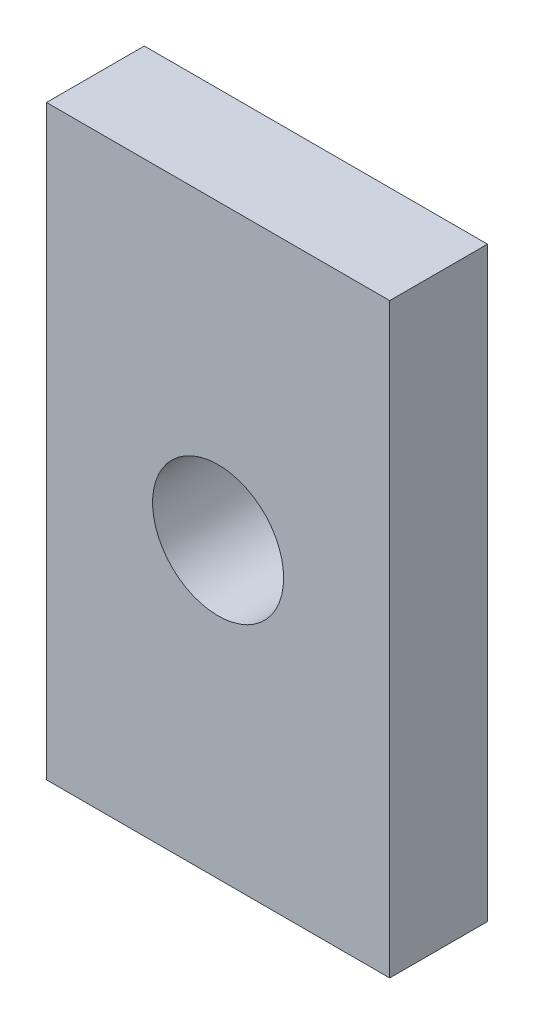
ISO-10303-21;
HEADER;
FILE_DESCRIPTION(('STEP AP214'),'2;1');
FILE_NAME('part.step','',(''),(''),'','','');
FILE_SCHEMA(('AUTOMOTIVE_DESIGN { 1 0 10303 214 1 1 1 1 }'));
ENDSEC;
DATA;
#1=APPLICATION_CONTEXT('core data for automotive mechanical design processes');
#2=APPLICATION_PROTOCOL_DEFINITION('international standard','automotive_design',2000,#1);
#3=PRODUCT_CONTEXT('',#1,'mechanical');
#4=PRODUCT('Part','Part','',(#3));
#5=PRODUCT_RELATED_PRODUCT_CATEGORY('part','',(#4));
#6=PRODUCT_DEFINITION_FORMATION('','',#4);
#7=PRODUCT_DEFINITION_CONTEXT('part definition',#1,'design');
#8=PRODUCT_DEFINITION('design','',#6,#7);
#9=PRODUCT_DEFINITION_SHAPE('','',#8);
#10=(LENGTH_UNIT() NAMED_UNIT(*) SI_UNIT(.MILLI.,.METRE.));
#11=(NAMED_UNIT(*) PLANE_ANGLE_UNIT() SI_UNIT($,.RADIAN.));
#12=(NAMED_UNIT(*) SI_UNIT($,.STERADIAN.) SOLID_ANGLE_UNIT());
#13=UNCERTAINTY_MEASURE_WITH_UNIT(LENGTH_MEASURE(1.E-05),#10,'distance_accuracy_value','');
#14=(GEOMETRIC_REPRESENTATION_CONTEXT(3) GLOBAL_UNCERTAINTY_ASSIGNED_CONTEXT((#13)) GLOBAL_UNIT_ASSIGNED_CONTEXT((#10,
#11,#12)) REPRESENTATION_CONTEXT('',''));
#15=CARTESIAN_POINT('',(0.,0.,0.));
#16=DIRECTION('',(0.,0.,1.));
#17=DIRECTION('',(1.,0.,0.));
#18=AXIS2_PLACEMENT_3D('',#15,#16,#17);
#19=CARTESIAN_POINT('',(-5.8824090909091,-27.94,-2.54));
#20=DIRECTION('',(0.,1.,0.));
#21=DIRECTION('',(0.,0.,1.));
#22=AXIS2_PLACEMENT_3D('',#19,#20,#21);
#23=PLANE('',#22);
#24=CARTESIAN_POINT('',(-5.65150000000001,-27.94,-2.54));
#25=DIRECTION('',(0.,1.,0.));
#26=DIRECTION('',(0.,0.,1.));
#27=AXIS2_PLACEMENT_3D('',#24,#25,#26);
#28=CIRCLE('',#27,2.54);
#29=CARTESIAN_POINT('',(-5.65150000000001,-27.94,0.));
#30=VERTEX_POINT('',#29);
#31=EDGE_CURVE('E20',#30,#30,#28,.F.);
#32=ORIENTED_EDGE('',*,*,#31,.T.);
#33=EDGE_LOOP('',(#32));
#34=FACE_BOUND('',#33,.T.);
#35=ADVANCED_FACE('F16',(#34),#23,.F.);
#36=CARTESIAN_POINT('',(5.4205909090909,-27.94,2.54));
#37=DIRECTION('',(0.,1.,0.));
#38=DIRECTION('',(0.,0.,1.));
#39=AXIS2_PLACEMENT_3D('',#36,#37,#38);
#40=PLANE('',#39);
#41=CARTESIAN_POINT('',(5.6515,-27.94,2.54));
#42=DIRECTION('',(0.,1.,0.));
#43=DIRECTION('',(0.,0.,1.));
#44=AXIS2_PLACEMENT_3D('',#41,#42,#43);
#45=CIRCLE('',#44,2.54);
#46=CARTESIAN_POINT('',(5.6515,-27.94,5.08));
#47=VERTEX_POINT('',#46);
#48=EDGE_CURVE('E303',#47,#47,#45,.F.);
#49=ORIENTED_EDGE('',*,*,#48,.T.);
#50=EDGE_LOOP('',(#49));
#51=FACE_BOUND('',#50,.T.);
#52=ADVANCED_FACE('F426',(#51),#40,.F.);
#53=CARTESIAN_POINT('',(15.7075909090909,-27.94,-2.54));
#54=DIRECTION('',(0.,1.,0.));
#55=DIRECTION('',(0.,0.,1.));
#56=AXIS2_PLACEMENT_3D('',#53,#54,#55);
#57=PLANE('',#56);
#58=CARTESIAN_POINT('',(15.9385,-27.94,-2.54));
#59=DIRECTION('',(0.,1.,0.));
#60=DIRECTION('',(0.,0.,1.));
#61=AXIS2_PLACEMENT_3D('',#58,#59,#60);
#62=CIRCLE('',#61,2.54);
#63=CARTESIAN_POINT('',(15.9385,-27.94,0.));
#64=VERTEX_POINT('',#63);
#65=EDGE_CURVE('E301',#64,#64,#62,.F.);
#66=ORIENTED_EDGE('',*,*,#65,.T.);
#67=EDGE_LOOP('',(#66));
#68=FACE_BOUND('',#67,.T.);
#69=ADVANCED_FACE('F423',(#68),#57,.F.);
#70=CARTESIAN_POINT('',(-16.1694090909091,-27.94,2.54));
#71=DIRECTION('',(0.,1.,0.));
#72=DIRECTION('',(0.,0.,1.));
#73=AXIS2_PLACEMENT_3D('',#70,#71,#72);
#74=PLANE('',#73);
#75=CARTESIAN_POINT('',(-15.9385,-27.94,2.54));
#76=DIRECTION('',(0.,1.,0.));
#77=DIRECTION('',(0.,0.,1.));
#78=AXIS2_PLACEMENT_3D('',#75,#76,#77);
#79=CIRCLE('',#78,2.54);
#80=CARTESIAN_POINT('',(-15.9385,-27.94,5.08));
#81=VERTEX_POINT('',#80);
#82=EDGE_CURVE('E158',#81,#81,#79,.F.);
#83=ORIENTED_EDGE('',*,*,#82,.T.);
#84=EDGE_LOOP('',(#83));
#85=FACE_BOUND('',#84,.T.);
#86=ADVANCED_FACE('F425',(#85),#74,.F.);
#87=CARTESIAN_POINT('',(-18.796,0.,-3.81));
#88=DIRECTION('',(0.,0.,1.));
#89=DIRECTION('',(1.,0.,0.));
#90=AXIS2_PLACEMENT_3D('',#87,#88,#89);
#91=PLANE('',#90);
#92=DIRECTION('',(-0.500000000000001,0.866025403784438,0.));
#93=VECTOR('',#92,1.);
#94=CARTESIAN_POINT('',(-18.415,1.09985226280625,-3.81));
#95=LINE('',#94,#93);
#96=CARTESIAN_POINT('',(-18.415,1.09985226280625,-3.81));
#97=VERTEX_POINT('',#96);
#98=CARTESIAN_POINT('',(-17.78,0.,-3.81));
#99=VERTEX_POINT('',#98);
#100=EDGE_CURVE('E146',#97,#99,#95,.F.);
#101=ORIENTED_EDGE('',*,*,#100,.T.);
#102=DIRECTION('',(0.500000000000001,0.866025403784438,0.));
#103=VECTOR('',#102,1.);
#104=CARTESIAN_POINT('',(-17.78,0.,-3.81));
#105=LINE('',#104,#103);
#106=CARTESIAN_POINT('',(-18.415,-1.09985226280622,-3.81));
#107=VERTEX_POINT('',#106);
#108=EDGE_CURVE('E149',#99,#107,#105,.F.);
#109=ORIENTED_EDGE('',*,*,#108,.T.);
#110=DIRECTION('',(1.,0.,0.));
#111=VECTOR('',#110,1.);
#112=CARTESIAN_POINT('',(-18.415,-1.09985226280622,-3.81));
#113=LINE('',#112,#111);
#114=CARTESIAN_POINT('',(-19.685,-1.09985226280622,-3.81));
#115=VERTEX_POINT('',#114);
#116=EDGE_CURVE('E172',#107,#115,#113,.F.);
#117=ORIENTED_EDGE('',*,*,#116,.T.);
#118=DIRECTION('',(0.500000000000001,-0.866025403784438,0.));
#119=VECTOR('',#118,1.);
#120=CARTESIAN_POINT('',(-19.685,-1.09985226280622,-3.81));
#121=LINE('',#120,#119);
#122=CARTESIAN_POINT('',(-20.32,0.,-3.81));
#123=VERTEX_POINT('',#122);
#124=EDGE_CURVE('E176',#115,#123,#121,.F.);
#125=ORIENTED_EDGE('',*,*,#124,.T.);
#126=DIRECTION('',(-0.500000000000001,-0.866025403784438,0.));
#127=VECTOR('',#126,1.);
#128=CARTESIAN_POINT('',(-20.32,0.,-3.81));
#129=LINE('',#128,#127);
#130=CARTESIAN_POINT('',(-19.685,1.09985226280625,-3.81));
#131=VERTEX_POINT('',#130);
#132=EDGE_CURVE('E181',#123,#131,#129,.F.);
#133=ORIENTED_EDGE('',*,*,#132,.T.);
#134=DIRECTION('',(1.,0.,0.));
#135=VECTOR('',#134,1.);
#136=CARTESIAN_POINT('',(-19.685,1.09985226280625,-3.81));
#137=LINE('',#136,#135);
#138=EDGE_CURVE('E152',#131,#97,#137,.T.);
#139=ORIENTED_EDGE('',*,*,#138,.T.);
#140=EDGE_LOOP('',(#101,#109,#117,#125,#133,#139));
#141=FACE_BOUND('',#140,.T.);
#142=ADVANCED_FACE('F148',(#141),#91,.F.);
#143=CARTESIAN_POINT('',(20.32,1.09985226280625,-3.81));
#144=DIRECTION('',(0.,0.,1.));
#145=DIRECTION('',(-1.,0.,0.));
#146=AXIS2_PLACEMENT_3D('',#143,#144,#145);
#147=PLANE('',#146);
#148=DIRECTION('',(-0.500000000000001,0.866025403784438,0.));
#149=VECTOR('',#148,1.);
#150=CARTESIAN_POINT('',(19.685,1.09985226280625,-3.81));
#151=LINE('',#150,#149);
#152=CARTESIAN_POINT('',(19.685,1.09985226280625,-3.81));
#153=VERTEX_POINT('',#152);
#154=CARTESIAN_POINT('',(20.3199999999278,-1.24999648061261E-10,-3.81));
#155=VERTEX_POINT('',#154);
#156=EDGE_CURVE('E187',#153,#155,#151,.F.);
#157=ORIENTED_EDGE('',*,*,#156,.T.);
#158=DIRECTION('',(0.500000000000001,0.866025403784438,0.));
#159=VECTOR('',#158,1.);
#160=CARTESIAN_POINT('',(20.32,0.,-3.81));
#161=LINE('',#160,#159);
#162=CARTESIAN_POINT('',(19.685,-1.09985226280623,-3.81));
#163=VERTEX_POINT('',#162);
#164=EDGE_CURVE('E194',#155,#163,#161,.F.);
#165=ORIENTED_EDGE('',*,*,#164,.T.);
#166=DIRECTION('',(1.,0.,0.));
#167=VECTOR('',#166,1.);
#168=CARTESIAN_POINT('',(19.685,-1.09985226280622,-3.81));
#169=LINE('',#168,#167);
#170=CARTESIAN_POINT('',(18.415,-1.09985226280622,-3.81));
#171=VERTEX_POINT('',#170);
#172=EDGE_CURVE('E199',#163,#171,#169,.F.);
#173=ORIENTED_EDGE('',*,*,#172,.T.);
#174=DIRECTION('',(0.500000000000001,-0.866025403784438,0.));
#175=VECTOR('',#174,1.);
#176=CARTESIAN_POINT('',(18.415,-1.09985226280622,-3.81));
#177=LINE('',#176,#175);
#178=CARTESIAN_POINT('',(17.7800000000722,1.24999736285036E-10,-3.81));
#179=VERTEX_POINT('',#178);
#180=EDGE_CURVE('E204',#171,#179,#177,.F.);
#181=ORIENTED_EDGE('',*,*,#180,.T.);
#182=DIRECTION('',(-0.500000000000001,-0.866025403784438,0.));
#183=VECTOR('',#182,1.);
#184=CARTESIAN_POINT('',(17.78,0.,-3.81));
#185=LINE('',#184,#183);
#186=CARTESIAN_POINT('',(18.415,1.09985226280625,-3.81));
#187=VERTEX_POINT('',#186);
#188=EDGE_CURVE('E113',#179,#187,#185,.F.);
#189=ORIENTED_EDGE('',*,*,#188,.T.);
#190=DIRECTION('',(1.,0.,0.));
#191=VECTOR('',#190,1.);
#192=CARTESIAN_POINT('',(18.415,1.09985226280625,-3.81));
#193=LINE('',#192,#191);
#194=EDGE_CURVE('E213',#187,#153,#193,.T.);
#195=ORIENTED_EDGE('',*,*,#194,.T.);
#196=EDGE_LOOP('',(#157,#165,#173,#181,#189,#195));
#197=FACE_BOUND('',#196,.T.);
#198=ADVANCED_FACE('F18',(#197),#147,.F.);
#199=CARTESIAN_POINT('',(0.213590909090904,31.75,-0.127000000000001));
#200=DIRECTION('',(0.,0.,1.));
#201=DIRECTION('',(1.,0.,0.));
#202=AXIS2_PLACEMENT_3D('',#199,#200,#201);
#203=PLANE('',#202);
#204=CARTESIAN_POINT('',(0.,31.75,-0.127000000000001));
#205=DIRECTION('',(0.,0.,1.));
#206=DIRECTION('',(1.,0.,0.));
#207=AXIS2_PLACEMENT_3D('',#204,#205,#206);
#208=CIRCLE('',#207,2.3495);
#209=CARTESIAN_POINT('',(2.3495,31.75,-0.127000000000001));
#210=VERTEX_POINT('',#209);
#211=EDGE_CURVE('E215',#210,#210,#208,.F.);
#212=ORIENTED_EDGE('',*,*,#211,.T.);
#213=EDGE_LOOP('',(#212));
#214=FACE_BOUND('',#213,.T.);
#215=ADVANCED_FACE('F325',(#214),#203,.F.);
#216=CARTESIAN_POINT('',(0.213590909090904,-31.75,-0.127000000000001));
#217=DIRECTION('',(0.,0.,1.));
#218=DIRECTION('',(1.,0.,0.));
#219=AXIS2_PLACEMENT_3D('',#216,#217,#218);
#220=PLANE('',#219);
#221=CARTESIAN_POINT('',(0.,-31.75,-0.127000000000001));
#222=DIRECTION('',(0.,0.,1.));
#223=DIRECTION('',(1.,0.,0.));
#224=AXIS2_PLACEMENT_3D('',#221,#222,#223);
#225=CIRCLE('',#224,2.3495);
#226=CARTESIAN_POINT('',(2.3495,-31.75,-0.127000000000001));
#227=VERTEX_POINT('',#226);
#228=EDGE_CURVE('E221',#227,#227,#225,.F.);
#229=ORIENTED_EDGE('',*,*,#228,.T.);
#230=EDGE_LOOP('',(#229));
#231=FACE_BOUND('',#230,.T.);
#232=ADVANCED_FACE('F314',(#231),#220,.F.);
#233=CARTESIAN_POINT('',(-5.65150000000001,-38.1,-2.54));
#234=DIRECTION('',(0.,1.,0.));
#235=DIRECTION('',(0.,0.,1.));
#236=AXIS2_PLACEMENT_3D('',#233,#234,#235);
#237=CYLINDRICAL_SURFACE('',#236,2.54);
#238=CARTESIAN_POINT('',(-5.65150000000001,-38.1,-2.54));
#239=DIRECTION('',(0.,1.,0.));
#240=DIRECTION('',(0.,0.,1.));
#241=AXIS2_PLACEMENT_3D('',#238,#239,#240);
#242=CIRCLE('',#241,2.54);
#243=CARTESIAN_POINT('',(-5.65150000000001,-38.1,0.));
#244=VERTEX_POINT('',#243);
#245=EDGE_CURVE('E223',#244,#244,#242,.T.);
#246=ORIENTED_EDGE('',*,*,#245,.F.);
#247=EDGE_LOOP('',(#246));
#248=FACE_BOUND('',#247,.T.);
#249=ORIENTED_EDGE('',*,*,#31,.F.);
#250=EDGE_LOOP('',(#249));
#251=FACE_BOUND('',#250,.T.);
#252=ADVANCED_FACE('F311',(#248,#251),#237,.F.);
#253=CARTESIAN_POINT('',(5.6515,-38.1,2.54));
#254=DIRECTION('',(0.,1.,0.));
#255=DIRECTION('',(0.,0.,1.));
#256=AXIS2_PLACEMENT_3D('',#253,#254,#255);
#257=CYLINDRICAL_SURFACE('',#256,2.54);
#258=CARTESIAN_POINT('',(5.6515,-38.1,2.54));
#259=DIRECTION('',(0.,1.,0.));
#260=DIRECTION('',(0.,0.,1.));
#261=AXIS2_PLACEMENT_3D('',#258,#259,#260);
#262=CIRCLE('',#261,2.54);
#263=CARTESIAN_POINT('',(5.6515,-38.1,5.08));
#264=VERTEX_POINT('',#263);
#265=EDGE_CURVE('E290',#264,#264,#262,.T.);
#266=ORIENTED_EDGE('',*,*,#265,.F.);
#267=EDGE_LOOP('',(#266));
#268=FACE_BOUND('',#267,.T.);
#269=ORIENTED_EDGE('',*,*,#48,.F.);
#270=EDGE_LOOP('',(#269));
#271=FACE_BOUND('',#270,.T.);
#272=ADVANCED_FACE('F313',(#268,#271),#257,.F.);
#273=CARTESIAN_POINT('',(15.9385,-38.1,-2.54));
#274=DIRECTION('',(0.,1.,0.));
#275=DIRECTION('',(0.,0.,1.));
#276=AXIS2_PLACEMENT_3D('',#273,#274,#275);
#277=CYLINDRICAL_SURFACE('',#276,2.54);
#278=CARTESIAN_POINT('',(15.9385,-38.1,-2.54));
#279=DIRECTION('',(0.,1.,0.));
#280=DIRECTION('',(0.,0.,1.));
#281=AXIS2_PLACEMENT_3D('',#278,#279,#280);
#282=CIRCLE('',#281,2.54);
#283=CARTESIAN_POINT('',(15.9385,-38.1,0.));
#284=VERTEX_POINT('',#283);
#285=EDGE_CURVE('E287',#284,#284,#282,.T.);
#286=ORIENTED_EDGE('',*,*,#285,.F.);
#287=EDGE_LOOP('',(#286));
#288=FACE_BOUND('',#287,.T.);
#289=ORIENTED_EDGE('',*,*,#65,.F.);
#290=EDGE_LOOP('',(#289));
#291=FACE_BOUND('',#290,.T.);
#292=ADVANCED_FACE('F322',(#288,#291),#277,.F.);
#293=CARTESIAN_POINT('',(-15.9385,-38.1,2.54));
#294=DIRECTION('',(0.,1.,0.));
#295=DIRECTION('',(0.,0.,1.));
#296=AXIS2_PLACEMENT_3D('',#293,#294,#295);
#297=CYLINDRICAL_SURFACE('',#296,2.54);
#298=CARTESIAN_POINT('',(-15.9385,-38.1,2.54));
#299=DIRECTION('',(0.,1.,0.));
#300=DIRECTION('',(0.,0.,1.));
#301=AXIS2_PLACEMENT_3D('',#298,#299,#300);
#302=CIRCLE('',#301,2.54);
#303=CARTESIAN_POINT('',(-15.9385,-38.1,5.08));
#304=VERTEX_POINT('',#303);
#305=EDGE_CURVE('E228',#304,#304,#302,.T.);
#306=ORIENTED_EDGE('',*,*,#305,.F.);
#307=EDGE_LOOP('',(#306));
#308=FACE_BOUND('',#307,.T.);
#309=ORIENTED_EDGE('',*,*,#82,.F.);
#310=EDGE_LOOP('',(#309));
#311=FACE_BOUND('',#310,.T.);
#312=ADVANCED_FACE('F411',(#308,#311),#297,.F.);
#313=CARTESIAN_POINT('',(-18.415,1.09985226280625,-6.35));
#314=DIRECTION('',(0.866025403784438,0.500000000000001,0.));
#315=DIRECTION('',(-0.500000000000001,0.866025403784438,0.));
#316=AXIS2_PLACEMENT_3D('',#313,#314,#315);
#317=PLANE('',#316);
#318=DIRECTION('',(0.,0.,1.));
#319=VECTOR('',#318,1.);
#320=CARTESIAN_POINT('',(-18.415,1.09985226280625,-6.35));
#321=LINE('',#320,#319);
#322=CARTESIAN_POINT('',(-18.415,1.09985226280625,-6.35));
#323=VERTEX_POINT('',#322);
#324=EDGE_CURVE('E183',#97,#323,#321,.F.);
#325=ORIENTED_EDGE('',*,*,#324,.T.);
#326=DIRECTION('',(0.499999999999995,-0.866025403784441,0.));
#327=VECTOR('',#326,1.);
#328=CARTESIAN_POINT('',(-18.415,1.09985226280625,-6.35));
#329=LINE('',#328,#327);
#330=CARTESIAN_POINT('',(-17.78,0.,-6.35));
#331=VERTEX_POINT('',#330);
#332=EDGE_CURVE('E169',#323,#331,#329,.T.);
#333=ORIENTED_EDGE('',*,*,#332,.T.);
#334=DIRECTION('',(0.,0.,1.));
#335=VECTOR('',#334,1.);
#336=CARTESIAN_POINT('',(-17.78,0.,-6.35));
#337=LINE('',#336,#335);
#338=EDGE_CURVE('E157',#331,#99,#337,.T.);
#339=ORIENTED_EDGE('',*,*,#338,.T.);
#340=ORIENTED_EDGE('',*,*,#100,.F.);
#341=EDGE_LOOP('',(#325,#333,#339,#340));
#342=FACE_BOUND('',#341,.T.);
#343=ADVANCED_FACE('F168',(#342),#317,.F.);
#344=CARTESIAN_POINT('',(-17.78,0.,-6.35));
#345=DIRECTION('',(0.866025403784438,-0.500000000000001,0.));
#346=DIRECTION('',(0.500000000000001,0.866025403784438,0.));
#347=AXIS2_PLACEMENT_3D('',#344,#345,#346);
#348=PLANE('',#347);
#349=ORIENTED_EDGE('',*,*,#338,.F.);
#350=DIRECTION('',(-0.500000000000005,-0.866025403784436,0.));
#351=VECTOR('',#350,1.);
#352=CARTESIAN_POINT('',(-17.78,0.,-6.35));
#353=LINE('',#352,#351);
#354=CARTESIAN_POINT('',(-18.415,-1.09985226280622,-6.35));
#355=VERTEX_POINT('',#354);
#356=EDGE_CURVE('E259',#331,#355,#353,.T.);
#357=ORIENTED_EDGE('',*,*,#356,.T.);
#358=DIRECTION('',(0.,0.,-1.));
#359=VECTOR('',#358,1.);
#360=CARTESIAN_POINT('',(-18.415,-1.09985226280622,-6.35));
#361=LINE('',#360,#359);
#362=EDGE_CURVE('E165',#355,#107,#361,.F.);
#363=ORIENTED_EDGE('',*,*,#362,.T.);
#364=ORIENTED_EDGE('',*,*,#108,.F.);
#365=EDGE_LOOP('',(#349,#357,#363,#364));
#366=FACE_BOUND('',#365,.T.);
#367=ADVANCED_FACE('F162',(#366),#348,.F.);
#368=CARTESIAN_POINT('',(-18.415,-1.09985226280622,-6.35));
#369=DIRECTION('',(0.,-1.,0.));
#370=DIRECTION('',(0.,0.,-1.));
#371=AXIS2_PLACEMENT_3D('',#368,#369,#370);
#372=PLANE('',#371);
#373=ORIENTED_EDGE('',*,*,#362,.F.);
#374=DIRECTION('',(1.,0.,0.));
#375=VECTOR('',#374,1.);
#376=CARTESIAN_POINT('',(0.,-1.09985226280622,-6.35));
#377=LINE('',#376,#375);
#378=CARTESIAN_POINT('',(-19.685,-1.09985226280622,-6.35));
#379=VERTEX_POINT('',#378);
#380=EDGE_CURVE('E256',#355,#379,#377,.F.);
#381=ORIENTED_EDGE('',*,*,#380,.T.);
#382=DIRECTION('',(0.,0.,1.));
#383=VECTOR('',#382,1.);
#384=CARTESIAN_POINT('',(-19.685,-1.09985226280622,-6.35));
#385=LINE('',#384,#383);
#386=EDGE_CURVE('E174',#379,#115,#385,.T.);
#387=ORIENTED_EDGE('',*,*,#386,.T.);
#388=ORIENTED_EDGE('',*,*,#116,.F.);
#389=EDGE_LOOP('',(#373,#381,#387,#388));
#390=FACE_BOUND('',#389,.T.);
#391=ADVANCED_FACE('F402',(#390),#372,.F.);
#392=CARTESIAN_POINT('',(-19.685,-1.09985226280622,-6.35));
#393=DIRECTION('',(-0.866025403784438,-0.500000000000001,0.));
#394=DIRECTION('',(0.500000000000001,-0.866025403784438,0.));
#395=AXIS2_PLACEMENT_3D('',#392,#393,#394);
#396=PLANE('',#395);
#397=ORIENTED_EDGE('',*,*,#386,.F.);
#398=DIRECTION('',(-0.500000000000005,0.866025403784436,0.));
#399=VECTOR('',#398,1.);
#400=CARTESIAN_POINT('',(-19.685,-1.09985226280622,-6.35));
#401=LINE('',#400,#399);
#402=CARTESIAN_POINT('',(-20.32,0.,-6.35));
#403=VERTEX_POINT('',#402);
#404=EDGE_CURVE('E253',#379,#403,#401,.T.);
#405=ORIENTED_EDGE('',*,*,#404,.T.);
#406=DIRECTION('',(0.,0.,1.));
#407=VECTOR('',#406,1.);
#408=CARTESIAN_POINT('',(-20.32,0.,-6.35));
#409=LINE('',#408,#407);
#410=EDGE_CURVE('E178',#403,#123,#409,.T.);
#411=ORIENTED_EDGE('',*,*,#410,.T.);
#412=ORIENTED_EDGE('',*,*,#124,.F.);
#413=EDGE_LOOP('',(#397,#405,#411,#412));
#414=FACE_BOUND('',#413,.T.);
#415=ADVANCED_FACE('F398',(#414),#396,.F.);
#416=CARTESIAN_POINT('',(-20.32,0.,-6.35));
#417=DIRECTION('',(-0.866025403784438,0.500000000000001,0.));
#418=DIRECTION('',(-0.500000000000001,-0.866025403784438,0.));
#419=AXIS2_PLACEMENT_3D('',#416,#417,#418);
#420=PLANE('',#419);
#421=ORIENTED_EDGE('',*,*,#410,.F.);
#422=DIRECTION('',(0.499999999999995,0.866025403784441,0.));
#423=VECTOR('',#422,1.);
#424=CARTESIAN_POINT('',(-20.32,0.,-6.35));
#425=LINE('',#424,#423);
#426=CARTESIAN_POINT('',(-19.685,1.09985226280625,-6.35));
#427=VERTEX_POINT('',#426);
#428=EDGE_CURVE('E250',#403,#427,#425,.T.);
#429=ORIENTED_EDGE('',*,*,#428,.T.);
#430=DIRECTION('',(0.,0.,1.));
#431=VECTOR('',#430,1.);
#432=CARTESIAN_POINT('',(-19.685,1.09985226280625,-6.35));
#433=LINE('',#432,#431);
#434=EDGE_CURVE('E188',#427,#131,#433,.T.);
#435=ORIENTED_EDGE('',*,*,#434,.T.);
#436=ORIENTED_EDGE('',*,*,#132,.F.);
#437=EDGE_LOOP('',(#421,#429,#435,#436));
#438=FACE_BOUND('',#437,.T.);
#439=ADVANCED_FACE('F394',(#438),#420,.F.);
#440=CARTESIAN_POINT('',(-19.685,1.09985226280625,-6.35));
#441=DIRECTION('',(0.,1.,0.));
#442=DIRECTION('',(0.,0.,1.));
#443=AXIS2_PLACEMENT_3D('',#440,#441,#442);
#444=PLANE('',#443);
#445=ORIENTED_EDGE('',*,*,#434,.F.);
#446=DIRECTION('',(1.,0.,0.));
#447=VECTOR('',#446,1.);
#448=CARTESIAN_POINT('',(0.,1.09985226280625,-6.35));
#449=LINE('',#448,#447);
#450=EDGE_CURVE('E247',#427,#323,#449,.T.);
#451=ORIENTED_EDGE('',*,*,#450,.T.);
#452=ORIENTED_EDGE('',*,*,#324,.F.);
#453=ORIENTED_EDGE('',*,*,#138,.F.);
#454=EDGE_LOOP('',(#445,#451,#452,#453));
#455=FACE_BOUND('',#454,.T.);
#456=ADVANCED_FACE('F390',(#455),#444,.F.);
#457=CARTESIAN_POINT('',(19.685,1.09985226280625,-6.35));
#458=DIRECTION('',(0.866025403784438,0.500000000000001,0.));
#459=DIRECTION('',(-0.500000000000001,0.866025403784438,0.));
#460=AXIS2_PLACEMENT_3D('',#457,#458,#459);
#461=PLANE('',#460);
#462=DIRECTION('',(0.,0.,1.));
#463=VECTOR('',#462,1.);
#464=CARTESIAN_POINT('',(19.685,1.09985226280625,-6.35));
#465=LINE('',#464,#463);
#466=CARTESIAN_POINT('',(19.685,1.09985226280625,-6.35));
#467=VERTEX_POINT('',#466);
#468=EDGE_CURVE('E210',#153,#467,#465,.F.);
#469=ORIENTED_EDGE('',*,*,#468,.T.);
#470=DIRECTION('',(0.499999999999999,-0.866025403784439,0.));
#471=VECTOR('',#470,1.);
#472=CARTESIAN_POINT('',(19.685,1.09985226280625,-6.35));
#473=LINE('',#472,#471);
#474=CARTESIAN_POINT('',(20.32,0.,-6.35));
#475=VERTEX_POINT('',#474);
#476=EDGE_CURVE('E244',#467,#475,#473,.T.);
#477=ORIENTED_EDGE('',*,*,#476,.T.);
#478=DIRECTION('',(0.,0.,1.));
#479=VECTOR('',#478,1.);
#480=CARTESIAN_POINT('',(20.32,0.,-6.35));
#481=LINE('',#480,#479);
#482=EDGE_CURVE('E193',#475,#155,#481,.T.);
#483=ORIENTED_EDGE('',*,*,#482,.T.);
#484=ORIENTED_EDGE('',*,*,#156,.F.);
#485=EDGE_LOOP('',(#469,#477,#483,#484));
#486=FACE_BOUND('',#485,.T.);
#487=ADVANCED_FACE('F386',(#486),#461,.F.);
#488=CARTESIAN_POINT('',(20.32,0.,-6.35));
#489=DIRECTION('',(0.866025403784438,-0.500000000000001,0.));
#490=DIRECTION('',(0.500000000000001,0.866025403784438,0.));
#491=AXIS2_PLACEMENT_3D('',#488,#489,#490);
#492=PLANE('',#491);
#493=ORIENTED_EDGE('',*,*,#482,.F.);
#494=DIRECTION('',(-0.500000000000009,-0.866025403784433,0.));
#495=VECTOR('',#494,1.);
#496=CARTESIAN_POINT('',(20.32,0.,-6.35));
#497=LINE('',#496,#495);
#498=CARTESIAN_POINT('',(19.685,-1.09985226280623,-6.35));
#499=VERTEX_POINT('',#498);
#500=EDGE_CURVE('E241',#475,#499,#497,.T.);
#501=ORIENTED_EDGE('',*,*,#500,.T.);
#502=DIRECTION('',(0.,0.,-1.));
#503=VECTOR('',#502,1.);
#504=CARTESIAN_POINT('',(19.685,-1.09985226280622,-6.35));
#505=LINE('',#504,#503);
#506=EDGE_CURVE('E196',#499,#163,#505,.F.);
#507=ORIENTED_EDGE('',*,*,#506,.T.);
#508=ORIENTED_EDGE('',*,*,#164,.F.);
#509=EDGE_LOOP('',(#493,#501,#507,#508));
#510=FACE_BOUND('',#509,.T.);
#511=ADVANCED_FACE('F382',(#510),#492,.F.);
#512=CARTESIAN_POINT('',(19.685,-1.09985226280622,-6.35));
#513=DIRECTION('',(0.,-1.,0.));
#514=DIRECTION('',(0.,0.,-1.));
#515=AXIS2_PLACEMENT_3D('',#512,#513,#514);
#516=PLANE('',#515);
#517=ORIENTED_EDGE('',*,*,#506,.F.);
#518=DIRECTION('',(1.,0.,0.));
#519=VECTOR('',#518,1.);
#520=CARTESIAN_POINT('',(0.,-1.09985226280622,-6.35));
#521=LINE('',#520,#519);
#522=CARTESIAN_POINT('',(18.415,-1.09985226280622,-6.35));
#523=VERTEX_POINT('',#522);
#524=EDGE_CURVE('E238',#499,#523,#521,.F.);
#525=ORIENTED_EDGE('',*,*,#524,.T.);
#526=DIRECTION('',(0.,0.,1.));
#527=VECTOR('',#526,1.);
#528=CARTESIAN_POINT('',(18.415,-1.09985226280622,-6.35));
#529=LINE('',#528,#527);
#530=EDGE_CURVE('E201',#523,#171,#529,.T.);
#531=ORIENTED_EDGE('',*,*,#530,.T.);
#532=ORIENTED_EDGE('',*,*,#172,.F.);
#533=EDGE_LOOP('',(#517,#525,#531,#532));
#534=FACE_BOUND('',#533,.T.);
#535=ADVANCED_FACE('F378',(#534),#516,.F.);
#536=CARTESIAN_POINT('',(18.415,-1.09985226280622,-6.35));
#537=DIRECTION('',(-0.866025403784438,-0.500000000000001,0.));
#538=DIRECTION('',(0.500000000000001,-0.866025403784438,0.));
#539=AXIS2_PLACEMENT_3D('',#536,#537,#538);
#540=PLANE('',#539);
#541=ORIENTED_EDGE('',*,*,#530,.F.);
#542=DIRECTION('',(-0.500000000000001,0.866025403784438,0.));
#543=VECTOR('',#542,1.);
#544=CARTESIAN_POINT('',(18.415,-1.09985226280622,-6.35));
#545=LINE('',#544,#543);
#546=CARTESIAN_POINT('',(17.78,0.,-6.35));
#547=VERTEX_POINT('',#546);
#548=EDGE_CURVE('E235',#523,#547,#545,.T.);
#549=ORIENTED_EDGE('',*,*,#548,.T.);
#550=DIRECTION('',(0.,0.,1.));
#551=VECTOR('',#550,1.);
#552=CARTESIAN_POINT('',(17.78,0.,-6.35));
#553=LINE('',#552,#551);
#554=EDGE_CURVE('E206',#547,#179,#553,.T.);
#555=ORIENTED_EDGE('',*,*,#554,.T.);
#556=ORIENTED_EDGE('',*,*,#180,.F.);
#557=EDGE_LOOP('',(#541,#549,#555,#556));
#558=FACE_BOUND('',#557,.T.);
#559=ADVANCED_FACE('F374',(#558),#540,.F.);
#560=CARTESIAN_POINT('',(17.78,0.,-6.35));
#561=DIRECTION('',(-0.866025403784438,0.500000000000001,0.));
#562=DIRECTION('',(-0.500000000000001,-0.866025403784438,0.));
#563=AXIS2_PLACEMENT_3D('',#560,#561,#562);
#564=PLANE('',#563);
#565=ORIENTED_EDGE('',*,*,#554,.F.);
#566=DIRECTION('',(0.499999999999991,0.866025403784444,0.));
#567=VECTOR('',#566,1.);
#568=CARTESIAN_POINT('',(17.78,0.,-6.35));
#569=LINE('',#568,#567);
#570=CARTESIAN_POINT('',(18.415,1.09985226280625,-6.35));
#571=VERTEX_POINT('',#570);
#572=EDGE_CURVE('E232',#547,#571,#569,.T.);
#573=ORIENTED_EDGE('',*,*,#572,.T.);
#574=DIRECTION('',(0.,0.,1.));
#575=VECTOR('',#574,1.);
#576=CARTESIAN_POINT('',(18.415,1.09985226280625,-6.35));
#577=LINE('',#576,#575);
#578=EDGE_CURVE('E57',#571,#187,#577,.T.);
#579=ORIENTED_EDGE('',*,*,#578,.T.);
#580=ORIENTED_EDGE('',*,*,#188,.F.);
#581=EDGE_LOOP('',(#565,#573,#579,#580));
#582=FACE_BOUND('',#581,.T.);
#583=ADVANCED_FACE('F371',(#582),#564,.F.);
#584=CARTESIAN_POINT('',(18.415,1.09985226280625,-6.35));
#585=DIRECTION('',(0.,1.,0.));
#586=DIRECTION('',(0.,0.,1.));
#587=AXIS2_PLACEMENT_3D('',#584,#585,#586);
#588=PLANE('',#587);
#589=ORIENTED_EDGE('',*,*,#578,.F.);
#590=DIRECTION('',(1.,0.,0.));
#591=VECTOR('',#590,1.);
#592=CARTESIAN_POINT('',(0.,1.09985226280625,-6.35));
#593=LINE('',#592,#591);
#594=EDGE_CURVE('E229',#571,#467,#593,.T.);
#595=ORIENTED_EDGE('',*,*,#594,.T.);
#596=ORIENTED_EDGE('',*,*,#468,.F.);
#597=ORIENTED_EDGE('',*,*,#194,.F.);
#598=EDGE_LOOP('',(#589,#595,#596,#597));
#599=FACE_BOUND('',#598,.T.);
#600=ADVANCED_FACE('F367',(#599),#588,.F.);
#601=CARTESIAN_POINT('',(0.,31.75,-6.35));
#602=DIRECTION('',(0.,0.,1.));
#603=DIRECTION('',(1.,0.,0.));
#604=AXIS2_PLACEMENT_3D('',#601,#602,#603);
#605=CYLINDRICAL_SURFACE('',#604,2.3495);
#606=ORIENTED_EDGE('',*,*,#211,.F.);
#607=EDGE_LOOP('',(#606));
#608=FACE_BOUND('',#607,.T.);
#609=CARTESIAN_POINT('',(0.,31.75,-6.35));
#610=DIRECTION('',(0.,0.,1.));
#611=DIRECTION('',(1.,0.,0.));
#612=AXIS2_PLACEMENT_3D('',#609,#610,#611);
#613=CIRCLE('',#612,2.3495);
#614=CARTESIAN_POINT('',(2.3495,31.75,-6.35));
#615=VERTEX_POINT('',#614);
#616=EDGE_CURVE('E231',#615,#615,#613,.F.);
#617=ORIENTED_EDGE('',*,*,#616,.T.);
#618=EDGE_LOOP('',(#617));
#619=FACE_BOUND('',#618,.T.);
#620=ADVANCED_FACE('F363',(#608,#619),#605,.F.);
#621=CARTESIAN_POINT('',(0.,-31.75,-6.35));
#622=DIRECTION('',(0.,0.,1.));
#623=DIRECTION('',(1.,0.,0.));
#624=AXIS2_PLACEMENT_3D('',#621,#622,#623);
#625=CYLINDRICAL_SURFACE('',#624,2.3495);
#626=ORIENTED_EDGE('',*,*,#228,.F.);
#627=EDGE_LOOP('',(#626));
#628=FACE_BOUND('',#627,.T.);
#629=CARTESIAN_POINT('',(0.,-31.75,-6.35));
#630=DIRECTION('',(0.,0.,1.));
#631=DIRECTION('',(1.,0.,0.));
#632=AXIS2_PLACEMENT_3D('',#629,#630,#631);
#633=CIRCLE('',#632,2.3495);
#634=CARTESIAN_POINT('',(2.3495,-31.75,-6.35));
#635=VERTEX_POINT('',#634);
#636=EDGE_CURVE('E277',#635,#635,#633,.F.);
#637=ORIENTED_EDGE('',*,*,#636,.T.);
#638=EDGE_LOOP('',(#637));
#639=FACE_BOUND('',#638,.T.);
#640=ADVANCED_FACE('F359',(#628,#639),#625,.F.);
#641=CARTESIAN_POINT('',(-22.2885,38.1,-6.35));
#642=DIRECTION('',(0.,1.,0.));
#643=DIRECTION('',(0.,0.,1.));
#644=AXIS2_PLACEMENT_3D('',#641,#642,#643);
#645=PLANE('',#644);
#646=DIRECTION('',(1.,0.,0.));
#647=VECTOR('',#646,1.);
#648=CARTESIAN_POINT('',(0.,38.1,-6.35));
#649=LINE('',#648,#647);
#650=CARTESIAN_POINT('',(22.2885,38.1,-6.35));
#651=VERTEX_POINT('',#650);
#652=CARTESIAN_POINT('',(-22.2885,38.1,-6.35));
#653=VERTEX_POINT('',#652);
#654=EDGE_CURVE('E265',#651,#653,#649,.F.);
#655=ORIENTED_EDGE('',*,*,#654,.T.);
#656=DIRECTION('',(0.,0.,1.));
#657=VECTOR('',#656,1.);
#658=CARTESIAN_POINT('',(-22.2885,38.1,-6.35));
#659=LINE('',#658,#657);
#660=CARTESIAN_POINT('',(-22.2885,38.1,6.35));
#661=VERTEX_POINT('',#660);
#662=EDGE_CURVE('E219',#661,#653,#659,.F.);
#663=ORIENTED_EDGE('',*,*,#662,.F.);
#664=DIRECTION('',(1.,0.,0.));
#665=VECTOR('',#664,1.);
#666=CARTESIAN_POINT('',(0.,38.1,6.35));
#667=LINE('',#666,#665);
#668=CARTESIAN_POINT('',(22.2885,38.1,6.35));
#669=VERTEX_POINT('',#668);
#670=EDGE_CURVE('E276',#669,#661,#667,.F.);
#671=ORIENTED_EDGE('',*,*,#670,.F.);
#672=DIRECTION('',(0.,0.,-1.));
#673=VECTOR('',#672,1.);
#674=CARTESIAN_POINT('',(22.2885,38.1,-6.35));
#675=LINE('',#674,#673);
#676=EDGE_CURVE('E48',#651,#669,#675,.F.);
#677=ORIENTED_EDGE('',*,*,#676,.F.);
#678=EDGE_LOOP('',(#655,#663,#671,#677));
#679=FACE_BOUND('',#678,.T.);
#680=ADVANCED_FACE('F355',(#679),#645,.T.);
#681=CARTESIAN_POINT('',(-22.2885,-38.1,-6.35));
#682=DIRECTION('',(-1.,0.,0.));
#683=DIRECTION('',(0.,0.,1.));
#684=AXIS2_PLACEMENT_3D('',#681,#682,#683);
#685=PLANE('',#684);
#686=DIRECTION('',(0.,1.,0.));
#687=VECTOR('',#686,1.);
#688=CARTESIAN_POINT('',(-22.2885,0.,-6.35));
#689=LINE('',#688,#687);
#690=CARTESIAN_POINT('',(-22.2885,-38.1,-6.35));
#691=VERTEX_POINT('',#690);
#692=EDGE_CURVE('E262',#653,#691,#689,.F.);
#693=ORIENTED_EDGE('',*,*,#692,.T.);
#694=DIRECTION('',(0.,0.,-1.));
#695=VECTOR('',#694,1.);
#696=CARTESIAN_POINT('',(-22.2885,-38.1,-6.35));
#697=LINE('',#696,#695);
#698=CARTESIAN_POINT('',(-22.2885,-38.1,6.35));
#699=VERTEX_POINT('',#698);
#700=EDGE_CURVE('E105',#699,#691,#697,.T.);
#701=ORIENTED_EDGE('',*,*,#700,.F.);
#702=DIRECTION('',(0.,1.,0.));
#703=VECTOR('',#702,1.);
#704=CARTESIAN_POINT('',(-22.2885,0.,6.35));
#705=LINE('',#704,#703);
#706=EDGE_CURVE('E274',#661,#699,#705,.F.);
#707=ORIENTED_EDGE('',*,*,#706,.F.);
#708=ORIENTED_EDGE('',*,*,#662,.T.);
#709=EDGE_LOOP('',(#693,#701,#707,#708));
#710=FACE_BOUND('',#709,.T.);
#711=ADVANCED_FACE('F351',(#710),#685,.T.);
#712=CARTESIAN_POINT('',(22.2885,-38.1,-6.35));
#713=DIRECTION('',(0.,-1.,0.));
#714=DIRECTION('',(0.,0.,-1.));
#715=AXIS2_PLACEMENT_3D('',#712,#713,#714);
#716=PLANE('',#715);
#717=ORIENTED_EDGE('',*,*,#305,.T.);
#718=EDGE_LOOP('',(#717));
#719=FACE_BOUND('',#718,.T.);
#720=ORIENTED_EDGE('',*,*,#285,.T.);
#721=EDGE_LOOP('',(#720));
#722=FACE_BOUND('',#721,.T.);
#723=ORIENTED_EDGE('',*,*,#265,.T.);
#724=EDGE_LOOP('',(#723));
#725=FACE_BOUND('',#724,.T.);
#726=ORIENTED_EDGE('',*,*,#245,.T.);
#727=EDGE_LOOP('',(#726));
#728=FACE_BOUND('',#727,.T.);
#729=DIRECTION('',(1.,0.,0.));
#730=VECTOR('',#729,1.);
#731=CARTESIAN_POINT('',(0.,-38.1,-6.35));
#732=LINE('',#731,#730);
#733=CARTESIAN_POINT('',(22.2885,-38.1,-6.35));
#734=VERTEX_POINT('',#733);
#735=EDGE_CURVE('E225',#691,#734,#732,.T.);
#736=ORIENTED_EDGE('',*,*,#735,.T.);
#737=DIRECTION('',(0.,0.,-1.));
#738=VECTOR('',#737,1.);
#739=CARTESIAN_POINT('',(22.2885,-38.1,-6.35));
#740=LINE('',#739,#738);
#741=CARTESIAN_POINT('',(22.2885,-38.1,6.35));
#742=VERTEX_POINT('',#741);
#743=EDGE_CURVE('E226',#742,#734,#740,.T.);
#744=ORIENTED_EDGE('',*,*,#743,.F.);
#745=DIRECTION('',(1.,0.,0.));
#746=VECTOR('',#745,1.);
#747=CARTESIAN_POINT('',(0.,-38.1,6.35));
#748=LINE('',#747,#746);
#749=EDGE_CURVE('E35',#699,#742,#748,.T.);
#750=ORIENTED_EDGE('',*,*,#749,.F.);
#751=ORIENTED_EDGE('',*,*,#700,.T.);
#752=EDGE_LOOP('',(#736,#744,#750,#751));
#753=FACE_BOUND('',#752,.T.);
#754=ADVANCED_FACE('F348',(#719,#722,#725,#728,#753),#716,.T.);
#755=CARTESIAN_POINT('',(22.2885,38.1,-6.35));
#756=DIRECTION('',(1.,0.,0.));
#757=DIRECTION('',(0.,0.,-1.));
#758=AXIS2_PLACEMENT_3D('',#755,#756,#757);
#759=PLANE('',#758);
#760=DIRECTION('',(0.,1.,0.));
#761=VECTOR('',#760,1.);
#762=CARTESIAN_POINT('',(22.2885,0.,-6.35));
#763=LINE('',#762,#761);
#764=EDGE_CURVE('E268',#734,#651,#763,.T.);
#765=ORIENTED_EDGE('',*,*,#764,.T.);
#766=ORIENTED_EDGE('',*,*,#676,.T.);
#767=DIRECTION('',(0.,1.,0.));
#768=VECTOR('',#767,1.);
#769=CARTESIAN_POINT('',(22.2885,0.,6.35));
#770=LINE('',#769,#768);
#771=EDGE_CURVE('E271',#742,#669,#770,.T.);
#772=ORIENTED_EDGE('',*,*,#771,.F.);
#773=ORIENTED_EDGE('',*,*,#743,.T.);
#774=EDGE_LOOP('',(#765,#766,#772,#773));
#775=FACE_BOUND('',#774,.T.);
#776=ADVANCED_FACE('F344',(#775),#759,.T.);
#777=CARTESIAN_POINT('',(0.,0.,-6.35));
#778=DIRECTION('',(0.,0.,1.));
#779=DIRECTION('',(1.,0.,0.));
#780=AXIS2_PLACEMENT_3D('',#777,#778,#779);
#781=PLANE('',#780);
#782=CARTESIAN_POINT('',(0.,0.,-6.35));
#783=DIRECTION('',(0.,0.,1.));
#784=DIRECTION('',(1.,0.,0.));
#785=AXIS2_PLACEMENT_3D('',#782,#783,#784);
#786=CIRCLE('',#785,8.509);
#787=CARTESIAN_POINT('',(8.509,0.,-6.35));
#788=VERTEX_POINT('',#787);
#789=EDGE_CURVE('E26',#788,#788,#786,.T.);
#790=ORIENTED_EDGE('',*,*,#789,.T.);
#791=EDGE_LOOP('',(#790));
#792=FACE_BOUND('',#791,.T.);
#793=ORIENTED_EDGE('',*,*,#636,.F.);
#794=EDGE_LOOP('',(#793));
#795=FACE_BOUND('',#794,.T.);
#796=ORIENTED_EDGE('',*,*,#616,.F.);
#797=EDGE_LOOP('',(#796));
#798=FACE_BOUND('',#797,.T.);
#799=ORIENTED_EDGE('',*,*,#572,.F.);
#800=ORIENTED_EDGE('',*,*,#548,.F.);
#801=ORIENTED_EDGE('',*,*,#524,.F.);
#802=ORIENTED_EDGE('',*,*,#500,.F.);
#803=ORIENTED_EDGE('',*,*,#476,.F.);
#804=ORIENTED_EDGE('',*,*,#594,.F.);
#805=EDGE_LOOP('',(#799,#800,#801,#802,#803,#804));
#806=FACE_BOUND('',#805,.T.);
#807=ORIENTED_EDGE('',*,*,#428,.F.);
#808=ORIENTED_EDGE('',*,*,#404,.F.);
#809=ORIENTED_EDGE('',*,*,#380,.F.);
#810=ORIENTED_EDGE('',*,*,#356,.F.);
#811=ORIENTED_EDGE('',*,*,#332,.F.);
#812=ORIENTED_EDGE('',*,*,#450,.F.);
#813=EDGE_LOOP('',(#807,#808,#809,#810,#811,#812));
#814=FACE_BOUND('',#813,.T.);
#815=ORIENTED_EDGE('',*,*,#654,.F.);
#816=ORIENTED_EDGE('',*,*,#764,.F.);
#817=ORIENTED_EDGE('',*,*,#735,.F.);
#818=ORIENTED_EDGE('',*,*,#692,.F.);
#819=EDGE_LOOP('',(#815,#816,#817,#818));
#820=FACE_BOUND('',#819,.T.);
#821=ADVANCED_FACE('F336',(#792,#795,#798,#806,#814,#820),#781,.F.);
#822=CARTESIAN_POINT('',(0.,0.,6.35));
#823=DIRECTION('',(0.,0.,1.));
#824=DIRECTION('',(1.,0.,0.));
#825=AXIS2_PLACEMENT_3D('',#822,#823,#824);
#826=PLANE('',#825);
#827=CARTESIAN_POINT('',(0.,0.,6.35));
#828=DIRECTION('',(0.,0.,1.));
#829=DIRECTION('',(1.,0.,0.));
#830=AXIS2_PLACEMENT_3D('',#827,#828,#829);
#831=CIRCLE('',#830,8.509);
#832=CARTESIAN_POINT('',(8.509,0.,6.35));
#833=VERTEX_POINT('',#832);
#834=EDGE_CURVE('E11',#833,#833,#831,.F.);
#835=ORIENTED_EDGE('',*,*,#834,.T.);
#836=EDGE_LOOP('',(#835));
#837=FACE_BOUND('',#836,.T.);
#838=ORIENTED_EDGE('',*,*,#749,.T.);
#839=ORIENTED_EDGE('',*,*,#771,.T.);
#840=ORIENTED_EDGE('',*,*,#670,.T.);
#841=ORIENTED_EDGE('',*,*,#706,.T.);
#842=EDGE_LOOP('',(#838,#839,#840,#841));
#843=FACE_BOUND('',#842,.T.);
#844=ADVANCED_FACE('F331',(#837,#843),#826,.T.);
#845=CARTESIAN_POINT('',(0.,0.,-6.35));
#846=DIRECTION('',(0.,0.,1.));
#847=DIRECTION('',(1.,0.,0.));
#848=AXIS2_PLACEMENT_3D('',#845,#846,#847);
#849=CYLINDRICAL_SURFACE('',#848,8.509);
#850=ORIENTED_EDGE('',*,*,#834,.F.);
#851=EDGE_LOOP('',(#850));
#852=FACE_BOUND('',#851,.T.);
#853=ORIENTED_EDGE('',*,*,#789,.F.);
#854=EDGE_LOOP('',(#853));
#855=FACE_BOUND('',#854,.T.);
#856=ADVANCED_FACE('F329',(#852,#855),#849,.F.);
#857=CLOSED_SHELL('',(#35,#52,#69,#86,#142,#198,#215,#232,#252,#272,#292,#312,#343,#367,#391,
#415,#439,#456,#487,#511,#535,#559,#583,#600,#620,#640,#680,#711,#754,#776,#821,#844,#856));
#858=MANIFOLD_SOLID_BREP('B1',#857);
#859=ADVANCED_BREP_SHAPE_REPRESENTATION('',(#18,#858),#14);
#860=SHAPE_DEFINITION_REPRESENTATION(#9,#859);
ENDSEC;
END-ISO-10303-21;
